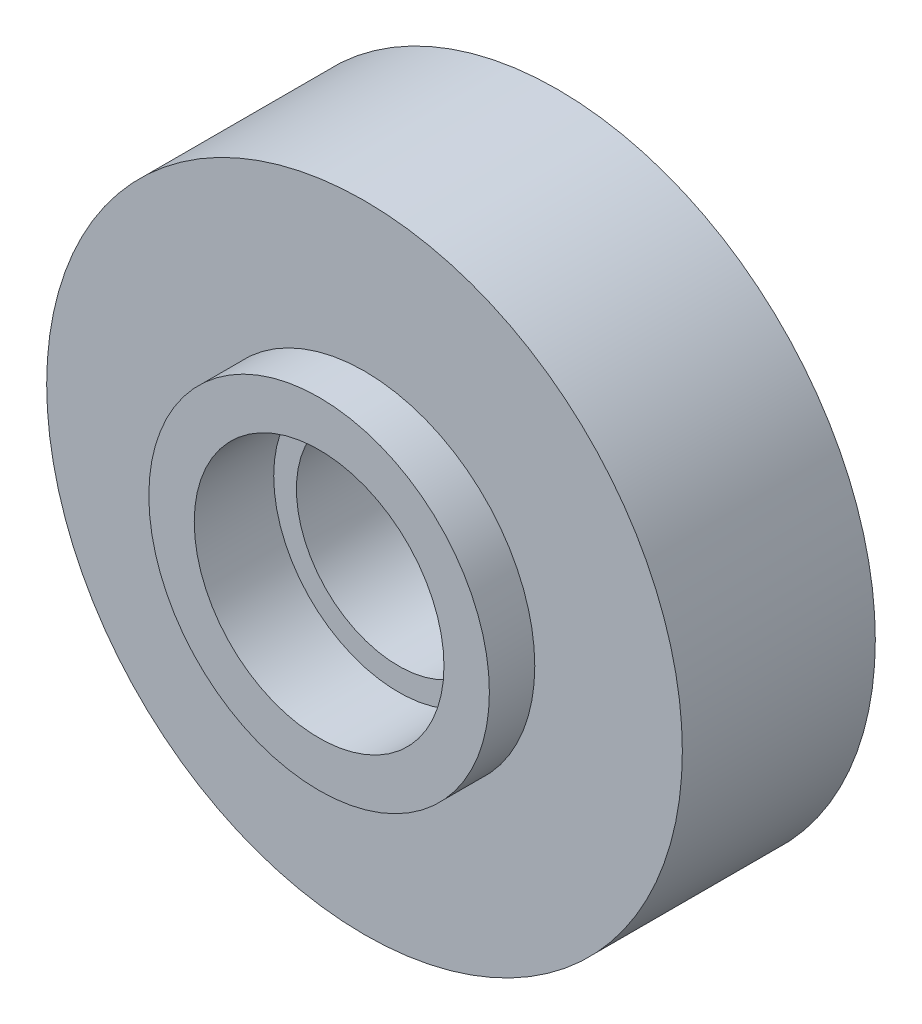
from build123d import *

# Parameters (mm, degrees)
SKETCH1_R           = 28
BOSS_EXTRUDE1_DEPTH = 17
SKETCH2_R           = 11
CUT_EXTRUDE1_DEPTH  = 3
SKETCH3_R           = 9
CUT_EXTRUDE2_DEPTH  = 43
CUT_EXTRUDE3_START  = -6.5
SKETCH4_R           = 11
CUT_EXTRUDE3_DEPTH  = 6.5
BOSS_EXTRUDE2_START = 4
SKETCH6_R           = 15
SKETCH6_R_2         = 11
BOSS_EXTRUDE2_DEPTH = 4


with BuildPart() as part:
    # Sketch1 → Boss-Extrude1 (new body)
    with BuildSketch(Plane.XY):
        Circle(SKETCH1_R)
    extrude(amount=BOSS_EXTRUDE1_DEPTH)

    # Sketch2 → Cut-Extrude1 (cut)
    with BuildSketch(Plane.XY.offset(17)):
        Circle(SKETCH2_R)
    extrude(amount=-CUT_EXTRUDE1_DEPTH, mode=Mode.SUBTRACT)

    # Sketch3 → Cut-Extrude2 (cut, through all)
    with BuildSketch(Plane.XY.offset(14)):
        Circle(SKETCH3_R)
    extrude(amount=-CUT_EXTRUDE2_DEPTH, mode=Mode.SUBTRACT)

    # Sketch4 → Cut-Extrude3 (cut)
    with BuildSketch(Plane(origin=(0, 0, 0), x_dir=(-1, 0, 0), z_dir=(0, 0, -1)).offset(CUT_EXTRUDE3_START)):
        with Locations(Location((0, 0, 0), (0, 0, 180))):
            Circle(SKETCH4_R)
    extrude(amount=CUT_EXTRUDE3_DEPTH, mode=Mode.SUBTRACT)

    # Sketch6 → Boss-Extrude2 (add)
    with BuildSketch(Plane.XY.offset(17).offset(BOSS_EXTRUDE2_START)):
        Circle(SKETCH6_R)
        Circle(SKETCH6_R_2, mode=Mode.SUBTRACT)
    extrude(amount=-BOSS_EXTRUDE2_DEPTH)


solid = part.part
